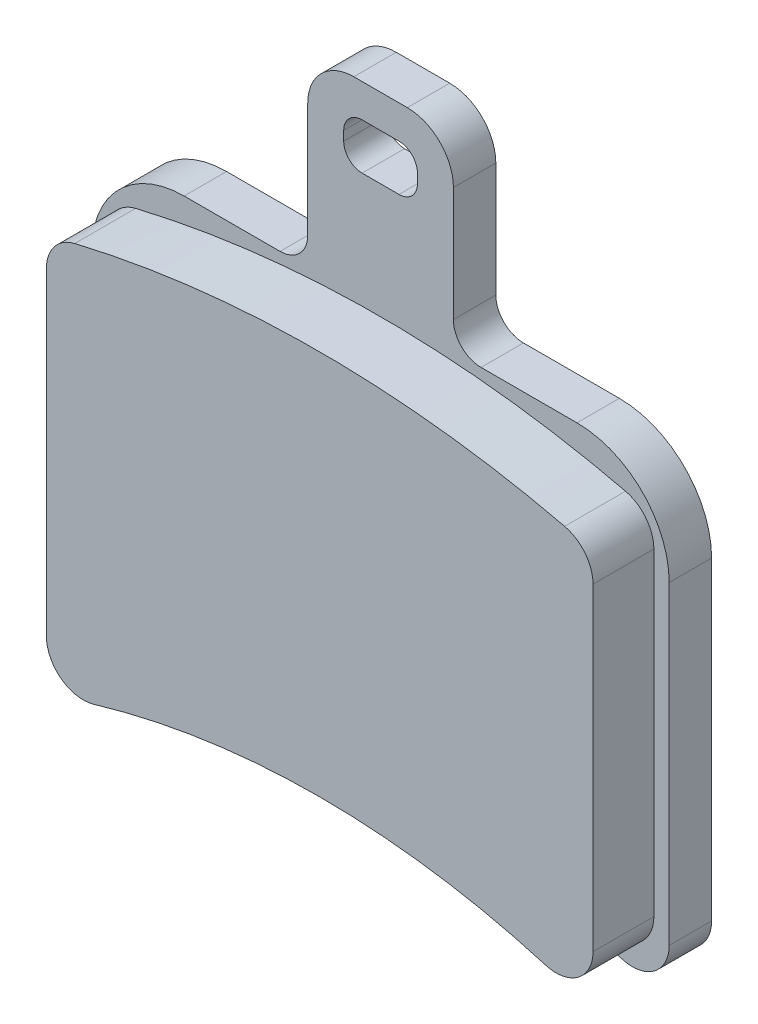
from build123d import *

# Parameters (mm, degrees)
EXTRUDE1_DEPTH     = 4.191
EXTRUDE2_DEPTH     = 2.921
CUT_EXTRUDE1_DEPTH = 2.921


with BuildPart() as part:
    # Sketch1 → Extrude1 (new body)
    with BuildSketch(Plane.XY):
        with BuildLine():
            Line((-18.8214, -4.446204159), (-18.8214, -26.3652))
            ThreePointArc((-18.8214, -26.3652), (-17.800959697, -28.400522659), (-15.559558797, -28.800471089))
            ThreePointArc((-15.559558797, -28.800471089), (0, -26.543), (15.559558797, -28.800471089))
            ThreePointArc((15.559558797, -28.800471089), (17.800959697, -28.400522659), (18.8214, -26.3652))
            Line((18.8214, -26.3652), (18.8214, -4.446204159))
            ThreePointArc((18.8214, -4.446204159), (18.274119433, -2.871190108), (16.868117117, -1.9748962))
            ThreePointArc((16.868117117, -1.9748962), (0, 0), (-16.868117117, -1.9748962))
            ThreePointArc((-16.868117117, -1.9748962), (-18.274119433, -2.871190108), (-18.8214, -4.446204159))
        make_face()
    extrude(amount=EXTRUDE1_DEPTH)

    # Sketch2 → Extrude2 (add)
    with BuildSketch(Plane.XY):
        with BuildLine():
            Line((-13.5255, 0.4318), (-6.9215, 0.4318))
            ThreePointArc((-6.9215, 0.4318), (-5.574461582, 0.989761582), (-5.0165, 2.3368))
            Line((-5.0165, 2.3368), (-5.0165, 10.2108))
            ThreePointArc((-5.0165, 10.2108), (-4.08656403, 12.45586403), (-1.8415, 13.3858))
            Line((-1.8415, 13.3858), (1.8415, 13.3858))
            ThreePointArc((1.8415, 13.3858), (4.08656403, 12.45586403), (5.0165, 10.2108))
            Line((5.0165, 10.2108), (5.0165, 2.3368))
            ThreePointArc((5.0165, 2.3368), (5.574461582, 0.989761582), (6.9215, 0.4318))
            Line((6.9215, 0.4318), (13.5255, 0.4318))
            ThreePointArc((13.5255, 0.4318), (18.015628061, -1.428071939), (19.8755, -5.9182))
            Line((19.8755, -5.9182), (19.8755, -27.559))
            ThreePointArc((19.8755, -27.559), (18.848426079, -29.599258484), (16.597819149, -29.989519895))
            ThreePointArc((16.597819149, -29.989519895), (0, -27.526217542), (-16.597819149, -29.989519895))
            ThreePointArc((-16.597819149, -29.989519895), (-18.848426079, -29.599258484), (-19.8755, -27.559))
            Line((-19.8755, -27.559), (-19.8755, -5.9182))
            ThreePointArc((-19.8755, -5.9182), (-18.015628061, -1.428071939), (-13.5255, 0.4318))
        make_face()
    extrude(amount=-EXTRUDE2_DEPTH)

    # Sketch3 → Cut-Extrude1 (cut)
    with BuildSketch(Plane.XY):
        with BuildLine():
            Line((-1.27, 11.0998), (1.27, 11.0998))
            ThreePointArc((1.27, 11.0998), (2.168025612, 10.727825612), (2.54, 9.8298))
            Line((2.54, 9.8298), (2.54, 9.1948))
            ThreePointArc((2.54, 9.1948), (2.168025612, 8.296774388), (1.27, 7.9248))
            Line((1.27, 7.9248), (-1.27, 7.9248))
            ThreePointArc((-1.27, 7.9248), (-2.168025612, 8.296774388), (-2.54, 9.1948))
            Line((-2.54, 9.1948), (-2.54, 9.8298))
            ThreePointArc((-2.54, 9.8298), (-2.168025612, 10.727825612), (-1.27, 11.0998))
        make_face()
    extrude(amount=-CUT_EXTRUDE1_DEPTH, mode=Mode.SUBTRACT)


solid = part.part
